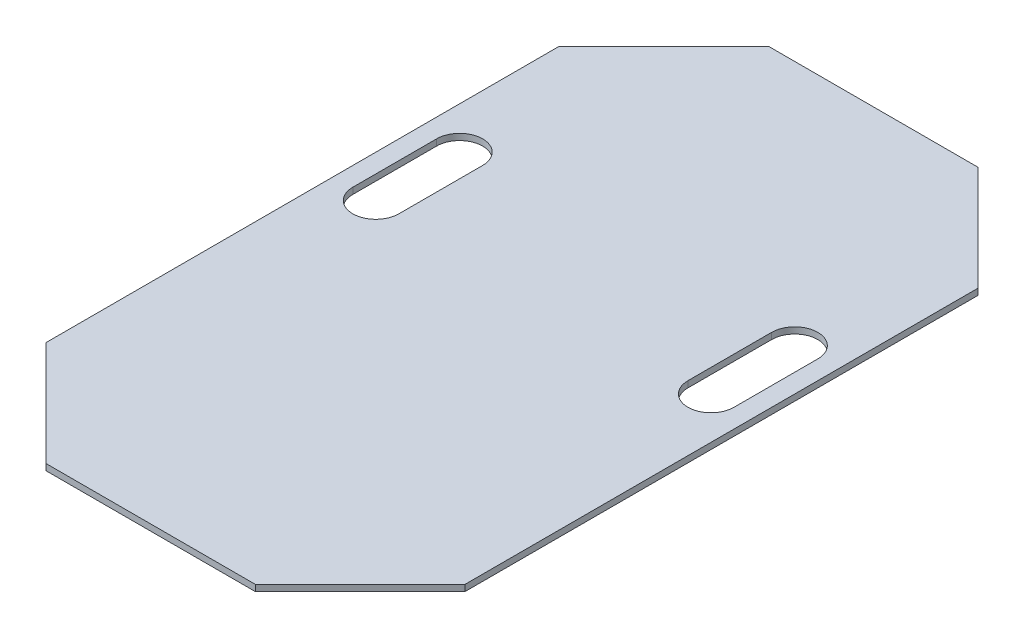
from build123d import *

# Parameters (mm, degrees)
EXTRUSION1_DEPTH        = 0.3
ENL_V_MAT_EXTRU_1_DEPTH = 33.457643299


with BuildPart() as part:
    # Esquisse1 → Extrusion1 (new body)
    with BuildSketch(Plane(origin=(0, 0, 0), x_dir=(1, 0, 0), z_dir=(0, 1, 0))):
        Polygon((-5, 3.622684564), (5, 3.622684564), (10, -1.377315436), (10, -25.877315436), (5, -30.877315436), (-5, -30.877315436), (-10, -25.877315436), (-10, -1.377315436), align=None)
    extrude(amount=EXTRUSION1_DEPTH)

    # Esquisse2 → Enl_v. mat.-Extru.1 (cut, through all)
    with BuildSketch(Plane(origin=(0, 0.3, 0), x_dir=(-1, 0, 0), z_dir=(0, 1, 0))):
        with BuildLine():
            Line((-9.1, 8.127315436), (-9.1, 12.127315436))
            ThreePointArc((-9.1, 12.127315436), (-8, 13.227315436), (-6.9, 12.127315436))
            Line((-6.9, 12.127315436), (-6.9, 8.127315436))
            ThreePointArc((-6.9, 8.127315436), (-8, 7.027315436), (-9.1, 8.127315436))
        make_face()
        with BuildLine():
            Line((6.9, 8.127315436), (6.9, 12.127315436))
            ThreePointArc((6.9, 12.127315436), (8, 13.227315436), (9.1, 12.127315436))
            Line((9.1, 12.127315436), (9.1, 8.127315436))
            ThreePointArc((9.1, 8.127315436), (8, 7.027315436), (6.9, 8.127315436))
        make_face()
    extrude(amount=-ENL_V_MAT_EXTRU_1_DEPTH, mode=Mode.SUBTRACT)


solid = part.part
